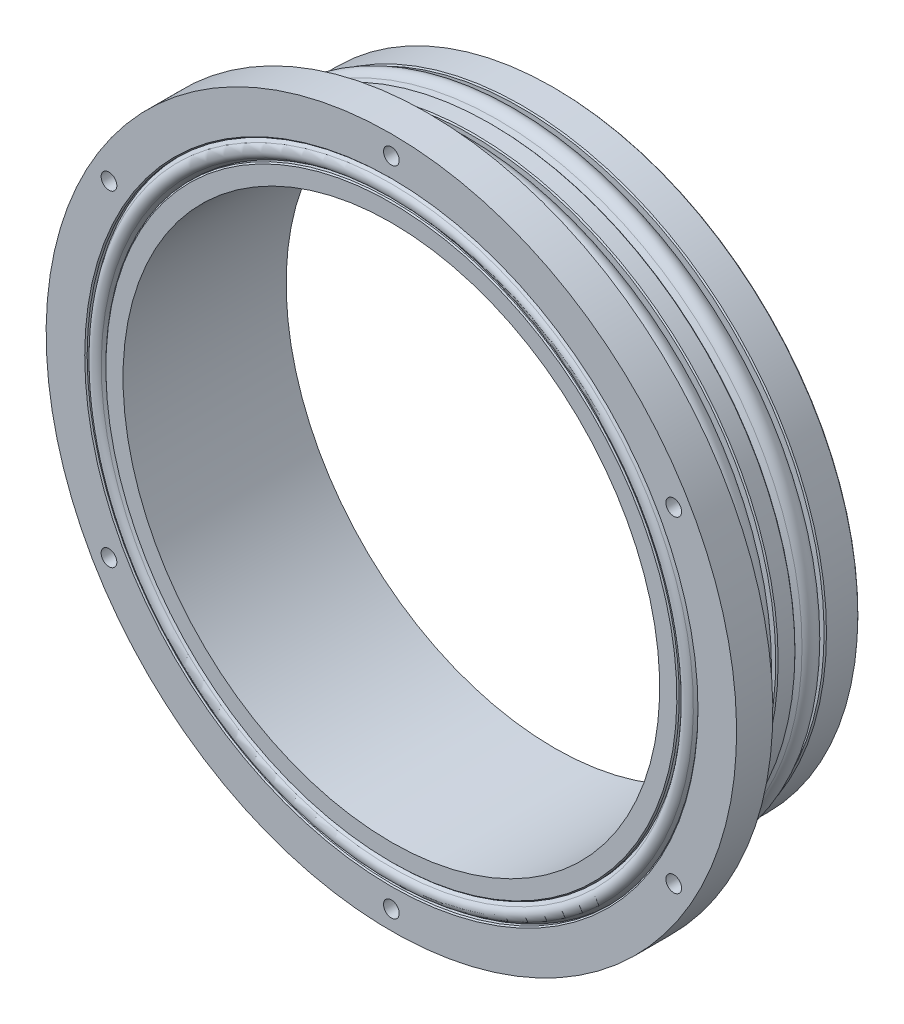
from build123d import *

# Parameters (mm, degrees)
SKETCH2_R          = 1.3
CUT_EXTRUDE1_DEPTH = 6
CHAMFER1_SIZE      = 0.2
SKETCH3_R          = 1.3
CUT_EXTRUDE2_DEPTH = 4


with BuildPart() as part:
    # Sketch1 → Revolve1 (revolve)
    with BuildSketch(Plane(origin=(0, 0, 0), x_dir=(0, 0, -1), z_dir=(1, 0, 0))):
        with BuildLine():
            Line((0, 50.419), (-5.587, 50.419))
            Line((-5.587, 50.419), (-5.587, 49.04105))
            Line((-5.587, 49.04105), (-6.547495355, 50.431651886))
            ThreePointArc((-6.547495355, 50.431651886), (-8, 51.1937), (-9.452504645, 50.431651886))
            Line((-9.452504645, 50.431651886), (-10.413, 49.04105))
            Line((-10.413, 49.04105), (-10.413, 50.419))
            Line((-10.413, 50.419), (-13.587, 50.419))
            Line((-13.587, 50.419), (-13.587, 49.04105))
            Line((-13.587, 49.04105), (-14.547495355, 50.431651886))
            ThreePointArc((-14.547495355, 50.431651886), (-16, 51.1937), (-17.452504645, 50.431651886))
            Line((-17.452504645, 50.431651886), (-18.413, 49.04105))
            Line((-18.413, 49.04105), (-18.413, 50.419))
            Line((-18.413, 50.419), (-21, 50.419))
            Line((-21, 50.419), (-21, 57.15))
            Line((-21, 57.15), (-27, 57.15))
            Line((-27, 57.15), (-27, 50.5587))
            Line((-27, 50.5587), (-26.279170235, 50.5587))
            Line((-26.279170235, 50.5587), (-27.01901462, 50.013761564))
            ThreePointArc((-27.01901462, 50.013761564), (-27.526692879, 49.0093), (-27.01901462, 48.004838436))
            Line((-27.01901462, 48.004838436), (-26.279170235, 47.4599))
            Line((-26.279170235, 47.4599), (-27, 47.4599))
            Line((-27, 47.4599), (-27, 44.419))
            Line((-27, 44.419), (0, 44.419))
            Line((0, 44.419), (0, 50.419))
        make_face()
    revolve(axis=Axis((0, 0, 0), (0, 0, 1)))

    # Sketch2 → Cut-Extrude1 (cut)
    with BuildSketch(Plane.XY.offset(27)):
        with Locations((0, 53.975)):
            Circle(SKETCH2_R)
        with Locations((46.743721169, 26.9875)):
            Circle(SKETCH2_R)
        with Locations((46.743721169, -26.9875)):
            Circle(SKETCH2_R)
        with Locations((0, -53.975)):
            Circle(SKETCH2_R)
        with Locations((-46.743721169, -26.9875)):
            Circle(SKETCH2_R)
        with Locations((-46.743721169, 26.9875)):
            Circle(SKETCH2_R)
    extrude(amount=-CUT_EXTRUDE1_DEPTH, mode=Mode.SUBTRACT)

    # Chamfer1
    chamfer1_edges = [part.edges().sort_by_distance(p)[0] for p in [
        (0, -47.4599, 27),
        (0, -50.5587, 27),
        (0, -50.419, 18.413),
        (0, -50.419, 13.587),
        (0, -50.419, 10.413),
        (0, -50.419, 5.587),
        (0, -50.419, 0),
    ]]
    chamfer(chamfer1_edges, length=CHAMFER1_SIZE)

    # Sketch3 → Cut-Extrude2 (cut)
    with BuildSketch(Plane(origin=(0, 0, 0), x_dir=(-1, 0, 0), z_dir=(0, 0, -1))):
        with Locations(Location((-46.99, 0, 0), (0, 0, 90))):
            Circle(SKETCH3_R)
        with Locations(Location((0, 46.99, 0), (0, 0, 90))):
            Circle(SKETCH3_R)
        with Locations(Location((46.99, 0, 0), (0, 0, 90))):
            Circle(SKETCH3_R)
        with Locations(Location((0, -46.99, 0), (0, 0, 90))):
            Circle(SKETCH3_R)
    extrude(amount=-CUT_EXTRUDE2_DEPTH, mode=Mode.SUBTRACT)


solid = part.part
